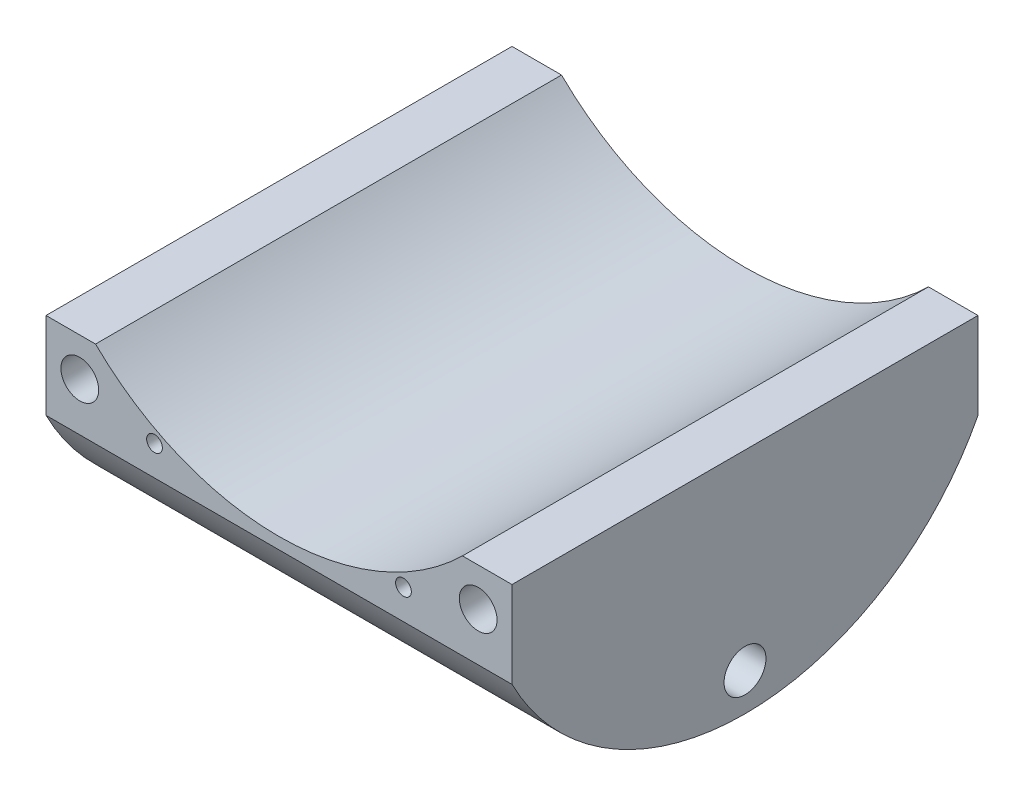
from build123d import *

# Parameters (mm, degrees)
BOSS_EXTRUDE1_DEPTH = 44.45
CUT_EXTRUDE1_DEPTH  = 109.537445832
SKETCH3_R           = 4
CUT_EXTRUDE2_DEPTH  = 17.5
SKETCH6_R           = 1.5
CUT_EXTRUDE3_DEPTH  = 14.5


with BuildPart() as part:
    # Sketch1 → Boss-Extrude1 (new, symmetric)
    with BuildSketch(Plane(origin=(0, 0, 0), x_dir=(0, 0, -1), z_dir=(1, 0, 0))):
        with BuildLine():
            Line((-44.45, 0), (44.45, 0))
            Line((44.45, 0), (44.45, -16.5))
            ThreePointArc((44.45, -16.5), (0, -43.604640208), (-44.45, -16.5))
            Line((-44.45, -16.5), (-44.45, 0))
        make_face()
    extrude(amount=BOSS_EXTRUDE1_DEPTH, both=True)

    # Sketch2 → Cut-Extrude1 (cut, through all)
    with BuildSketch(Plane(origin=(0, 0, -44.45), x_dir=(-1, 0, 0), z_dir=(0, 0, -1))):
        with BuildLine():
            Line((-35, 0), (35, 0))
            ThreePointArc((35, 0), (0, -14.292857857), (-35, 0))
        make_face()
    extrude(amount=-CUT_EXTRUDE1_DEPTH, mode=Mode.SUBTRACT)

    # Sketch3 → Cut-Extrude2 (cut)
    with BuildSketch(Plane(origin=(44.45, 0, 0), x_dir=(0, 0, -1), z_dir=(1, 0, 0))):
        with Locations((0, -36.45)):
            Circle(SKETCH3_R)
    cut_extrude2 = extrude(amount=-CUT_EXTRUDE2_DEPTH, mode=Mode.SUBTRACT)

    # Mirror1: Cut-Extrude2 across plane
    add(cut_extrude2.mirror(Plane(origin=(0, 0, 0), x_dir=(0, 0, 1), z_dir=(1, 0, 0))), mode=Mode.SUBTRACT)

    # Sketch4 → 7.2 _7.2_ Diameter Hole1 (revolve, cut)
    with BuildSketch(Plane(origin=(38, -7.3, -44.45), x_dir=(0, 1, 0), z_dir=(1, 0, 0))):
        Polygon((0, 0), (0, 22.813098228), (3.6, 20.65), (3.6, 0), align=None)
    f_7_2_7_2_diameter_hole1 = revolve(axis=Axis((38, -7.3, -50.8), (0, 0, 1)), mode=Mode.SUBTRACT)

    # Mirror2: 7.2 _7.2_ Diameter Hole1 across plane
    add(f_7_2_7_2_diameter_hole1.mirror(Plane(origin=(0, 0, 0), x_dir=(0, 0, 1), z_dir=(1, 0, 0))), mode=Mode.SUBTRACT)

    # Mirror3: 7.2 _7.2_ Diameter Hole1 across plane
    add(f_7_2_7_2_diameter_hole1.mirror(Plane.XY), mode=Mode.SUBTRACT)

    # Mirror3 copy 1 sketch → Mirror3 copy 1 (revolve, cut)
    with BuildSketch(Plane(origin=(-38, -7.3, 44.45), x_dir=(0, 1, 0), z_dir=(-1, 0, 0))):
        Polygon((0, 0), (0, 22.813098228), (3.6, 20.65), (3.6, 0), align=None)
    revolve(axis=Axis((-38, -7.3, 50.8), (0, 0, -1)), mode=Mode.SUBTRACT)

    # Sketch6 → Cut-Extrude3 (cut)
    with BuildSketch(Plane.XY.offset(44.45)):
        with Locations((-23.75, -10.8)):
            Circle(SKETCH6_R)
        with Locations((23.75, -10.8)):
            Circle(SKETCH6_R)
    cut_extrude3 = extrude(amount=-CUT_EXTRUDE3_DEPTH, mode=Mode.SUBTRACT)

    # Mirror4: Cut-Extrude3 across plane
    add(cut_extrude3.mirror(Plane.XY), mode=Mode.SUBTRACT)


solid = part.part
